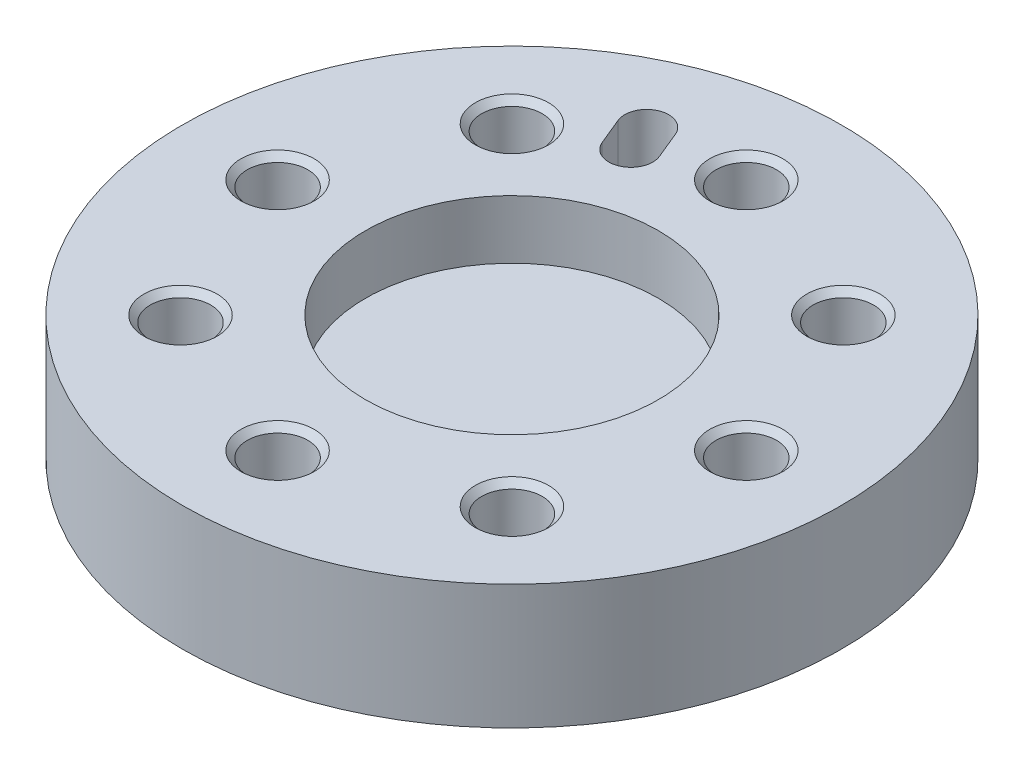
ISO-10303-21;
HEADER;
FILE_DESCRIPTION(('STEP AP214'),'2;1');
FILE_NAME('part.step','',(''),(''),'','','');
FILE_SCHEMA(('AUTOMOTIVE_DESIGN { 1 0 10303 214 1 1 1 1 }'));
ENDSEC;
DATA;
#1=APPLICATION_CONTEXT('core data for automotive mechanical design processes');
#2=APPLICATION_PROTOCOL_DEFINITION('international standard','automotive_design',2000,#1);
#3=PRODUCT_CONTEXT('',#1,'mechanical');
#4=PRODUCT('Part','Part','',(#3));
#5=PRODUCT_RELATED_PRODUCT_CATEGORY('part','',(#4));
#6=PRODUCT_DEFINITION_FORMATION('','',#4);
#7=PRODUCT_DEFINITION_CONTEXT('part definition',#1,'design');
#8=PRODUCT_DEFINITION('design','',#6,#7);
#9=PRODUCT_DEFINITION_SHAPE('','',#8);
#10=(LENGTH_UNIT() NAMED_UNIT(*) SI_UNIT(.MILLI.,.METRE.));
#11=(NAMED_UNIT(*) PLANE_ANGLE_UNIT() SI_UNIT($,.RADIAN.));
#12=(NAMED_UNIT(*) SI_UNIT($,.STERADIAN.) SOLID_ANGLE_UNIT());
#13=UNCERTAINTY_MEASURE_WITH_UNIT(LENGTH_MEASURE(1.E-05),#10,'distance_accuracy_value','');
#14=(GEOMETRIC_REPRESENTATION_CONTEXT(3) GLOBAL_UNCERTAINTY_ASSIGNED_CONTEXT((#13)) GLOBAL_UNIT_ASSIGNED_CONTEXT((#10,
#11,#12)) REPRESENTATION_CONTEXT('',''));
#15=CARTESIAN_POINT('',(0.,0.,0.));
#16=DIRECTION('',(0.,0.,1.));
#17=DIRECTION('',(1.,0.,0.));
#18=AXIS2_PLACEMENT_3D('',#15,#16,#17);
#19=CARTESIAN_POINT('',(0.,-8.,-16.));
#20=DIRECTION('',(0.,1.,0.));
#21=DIRECTION('',(0.,0.,1.));
#22=AXIS2_PLACEMENT_3D('',#19,#20,#21);
#23=PLANE('',#22);
#24=CARTESIAN_POINT('',(0.,-8.,-16.));
#25=DIRECTION('',(0.,-1.,0.));
#26=DIRECTION('',(0.,0.,-1.));
#27=AXIS2_PLACEMENT_3D('',#24,#25,#26);
#28=CIRCLE('',#27,2.067);
#29=CARTESIAN_POINT('',(0.,-8.,-18.067));
#30=VERTEX_POINT('',#29);
#31=EDGE_CURVE('E20',#30,#30,#28,.F.);
#32=ORIENTED_EDGE('',*,*,#31,.T.);
#33=EDGE_LOOP('',(#32));
#34=FACE_BOUND('',#33,.T.);
#35=ADVANCED_FACE('F17',(#34),#23,.T.);
#36=CARTESIAN_POINT('',(-16.,-8.,0.));
#37=DIRECTION('',(0.,1.,0.));
#38=DIRECTION('',(0.,0.,1.));
#39=AXIS2_PLACEMENT_3D('',#36,#37,#38);
#40=PLANE('',#39);
#41=CARTESIAN_POINT('',(-16.,-8.,0.));
#42=DIRECTION('',(0.,-1.,0.));
#43=DIRECTION('',(0.,0.,-1.));
#44=AXIS2_PLACEMENT_3D('',#41,#42,#43);
#45=CIRCLE('',#44,2.067);
#46=CARTESIAN_POINT('',(-16.,-8.,-2.067));
#47=VERTEX_POINT('',#46);
#48=EDGE_CURVE('E165',#47,#47,#45,.F.);
#49=ORIENTED_EDGE('',*,*,#48,.T.);
#50=EDGE_LOOP('',(#49));
#51=FACE_BOUND('',#50,.T.);
#52=ADVANCED_FACE('F285',(#51),#40,.T.);
#53=CARTESIAN_POINT('',(0.,-8.,16.));
#54=DIRECTION('',(0.,1.,0.));
#55=DIRECTION('',(0.,0.,1.));
#56=AXIS2_PLACEMENT_3D('',#53,#54,#55);
#57=PLANE('',#56);
#58=CARTESIAN_POINT('',(0.,-8.,16.));
#59=DIRECTION('',(0.,-1.,0.));
#60=DIRECTION('',(0.,0.,-1.));
#61=AXIS2_PLACEMENT_3D('',#58,#59,#60);
#62=CIRCLE('',#61,2.067);
#63=CARTESIAN_POINT('',(0.,-8.,13.933));
#64=VERTEX_POINT('',#63);
#65=EDGE_CURVE('E163',#64,#64,#62,.F.);
#66=ORIENTED_EDGE('',*,*,#65,.T.);
#67=EDGE_LOOP('',(#66));
#68=FACE_BOUND('',#67,.T.);
#69=ADVANCED_FACE('F282',(#68),#57,.T.);
#70=CARTESIAN_POINT('',(16.,-8.,0.));
#71=DIRECTION('',(0.,1.,0.));
#72=DIRECTION('',(0.,0.,1.));
#73=AXIS2_PLACEMENT_3D('',#70,#71,#72);
#74=PLANE('',#73);
#75=CARTESIAN_POINT('',(16.,-8.,0.));
#76=DIRECTION('',(0.,-1.,0.));
#77=DIRECTION('',(0.,0.,-1.));
#78=AXIS2_PLACEMENT_3D('',#75,#76,#77);
#79=CIRCLE('',#78,2.067);
#80=CARTESIAN_POINT('',(16.,-8.,-2.067));
#81=VERTEX_POINT('',#80);
#82=EDGE_CURVE('E160',#81,#81,#79,.F.);
#83=ORIENTED_EDGE('',*,*,#82,.T.);
#84=EDGE_LOOP('',(#83));
#85=FACE_BOUND('',#84,.T.);
#86=ADVANCED_FACE('F278',(#85),#74,.T.);
#87=CARTESIAN_POINT('',(11.3137084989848,-8.,11.3137084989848));
#88=DIRECTION('',(0.,1.,0.));
#89=DIRECTION('',(0.,0.,1.));
#90=AXIS2_PLACEMENT_3D('',#87,#88,#89);
#91=PLANE('',#90);
#92=CARTESIAN_POINT('',(11.3137084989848,-8.,11.3137084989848));
#93=DIRECTION('',(0.,-1.,0.));
#94=DIRECTION('',(0.,0.,-1.));
#95=AXIS2_PLACEMENT_3D('',#92,#93,#94);
#96=CIRCLE('',#95,2.067);
#97=CARTESIAN_POINT('',(11.3137084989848,-8.,9.24670849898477));
#98=VERTEX_POINT('',#97);
#99=EDGE_CURVE('E157',#98,#98,#96,.F.);
#100=ORIENTED_EDGE('',*,*,#99,.T.);
#101=EDGE_LOOP('',(#100));
#102=FACE_BOUND('',#101,.T.);
#103=ADVANCED_FACE('F274',(#102),#91,.T.);
#104=CARTESIAN_POINT('',(-11.3137084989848,-8.,11.3137084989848));
#105=DIRECTION('',(0.,1.,0.));
#106=DIRECTION('',(0.,0.,1.));
#107=AXIS2_PLACEMENT_3D('',#104,#105,#106);
#108=PLANE('',#107);
#109=CARTESIAN_POINT('',(-11.3137084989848,-8.,11.3137084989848));
#110=DIRECTION('',(0.,-1.,0.));
#111=DIRECTION('',(0.,0.,-1.));
#112=AXIS2_PLACEMENT_3D('',#109,#110,#111);
#113=CIRCLE('',#112,2.067);
#114=CARTESIAN_POINT('',(-11.3137084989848,-8.,9.24670849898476));
#115=VERTEX_POINT('',#114);
#116=EDGE_CURVE('E154',#115,#115,#113,.F.);
#117=ORIENTED_EDGE('',*,*,#116,.T.);
#118=EDGE_LOOP('',(#117));
#119=FACE_BOUND('',#118,.T.);
#120=ADVANCED_FACE('F270',(#119),#108,.T.);
#121=CARTESIAN_POINT('',(-11.3137084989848,-8.,-11.3137084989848));
#122=DIRECTION('',(0.,1.,0.));
#123=DIRECTION('',(0.,0.,1.));
#124=AXIS2_PLACEMENT_3D('',#121,#122,#123);
#125=PLANE('',#124);
#126=CARTESIAN_POINT('',(-11.3137084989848,-8.,-11.3137084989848));
#127=DIRECTION('',(0.,-1.,0.));
#128=DIRECTION('',(0.,0.,-1.));
#129=AXIS2_PLACEMENT_3D('',#126,#127,#128);
#130=CIRCLE('',#129,2.067);
#131=CARTESIAN_POINT('',(-11.3137084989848,-8.,-13.3807084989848));
#132=VERTEX_POINT('',#131);
#133=EDGE_CURVE('E151',#132,#132,#130,.F.);
#134=ORIENTED_EDGE('',*,*,#133,.T.);
#135=EDGE_LOOP('',(#134));
#136=FACE_BOUND('',#135,.T.);
#137=ADVANCED_FACE('F266',(#136),#125,.T.);
#138=CARTESIAN_POINT('',(11.3137084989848,-8.,-11.3137084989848));
#139=DIRECTION('',(0.,1.,0.));
#140=DIRECTION('',(0.,0.,1.));
#141=AXIS2_PLACEMENT_3D('',#138,#139,#140);
#142=PLANE('',#141);
#143=CARTESIAN_POINT('',(11.3137084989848,-8.,-11.3137084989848));
#144=DIRECTION('',(0.,-1.,0.));
#145=DIRECTION('',(0.,0.,-1.));
#146=AXIS2_PLACEMENT_3D('',#143,#144,#145);
#147=CIRCLE('',#146,2.067);
#148=CARTESIAN_POINT('',(11.3137084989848,-8.,-13.3807084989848));
#149=VERTEX_POINT('',#148);
#150=EDGE_CURVE('E67',#149,#149,#147,.F.);
#151=ORIENTED_EDGE('',*,*,#150,.T.);
#152=EDGE_LOOP('',(#151));
#153=FACE_BOUND('',#152,.T.);
#154=ADVANCED_FACE('F263',(#153),#142,.T.);
#155=CARTESIAN_POINT('',(-6.50561835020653,-3.5,-15.7059520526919));
#156=DIRECTION('',(0.,1.,0.));
#157=DIRECTION('',(0.,0.,1.));
#158=AXIS2_PLACEMENT_3D('',#155,#156,#157);
#159=PLANE('',#158);
#160=CARTESIAN_POINT('',(-5.74025148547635,-3.5,-13.8581929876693));
#161=DIRECTION('',(0.,1.,0.));
#162=DIRECTION('',(0.,0.,1.));
#163=AXIS2_PLACEMENT_3D('',#160,#161,#162);
#164=CIRCLE('',#163,1.5);
#165=CARTESIAN_POINT('',(-7.12607078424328,-3.5,-13.2841678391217));
#166=VERTEX_POINT('',#165);
#167=CARTESIAN_POINT('',(-4.35443218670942,-3.5,-14.4322181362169));
#168=VERTEX_POINT('',#167);
#169=EDGE_CURVE('E56',#166,#168,#164,.T.);
#170=ORIENTED_EDGE('',*,*,#169,.T.);
#171=DIRECTION('',(-0.38268343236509,0.,-0.923879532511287));
#172=VECTOR('',#171,1.);
#173=CARTESIAN_POINT('',(-4.35443218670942,-3.5,-14.4322181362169));
#174=LINE('',#173,#172);
#175=CARTESIAN_POINT('',(-5.1197990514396,-3.5,-16.2799772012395));
#176=VERTEX_POINT('',#175);
#177=EDGE_CURVE('E59',#168,#176,#174,.T.);
#178=ORIENTED_EDGE('',*,*,#177,.T.);
#179=CARTESIAN_POINT('',(-6.50561835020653,-3.5,-15.7059520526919));
#180=DIRECTION('',(0.,1.,0.));
#181=DIRECTION('',(0.,0.,1.));
#182=AXIS2_PLACEMENT_3D('',#179,#180,#181);
#183=CIRCLE('',#182,1.5);
#184=CARTESIAN_POINT('',(-7.89143764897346,-3.5,-15.1319269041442));
#185=VERTEX_POINT('',#184);
#186=EDGE_CURVE('E147',#176,#185,#183,.T.);
#187=ORIENTED_EDGE('',*,*,#186,.T.);
#188=DIRECTION('',(0.38268343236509,0.,0.923879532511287));
#189=VECTOR('',#188,1.);
#190=CARTESIAN_POINT('',(-7.89143764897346,-3.5,-15.1319269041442));
#191=LINE('',#190,#189);
#192=EDGE_CURVE('E61',#185,#166,#191,.T.);
#193=ORIENTED_EDGE('',*,*,#192,.T.);
#194=EDGE_LOOP('',(#170,#178,#187,#193));
#195=FACE_BOUND('',#194,.T.);
#196=ADVANCED_FACE('F58',(#195),#159,.T.);
#197=CARTESIAN_POINT('',(0.,0.,-16.));
#198=DIRECTION('',(0.,-1.,0.));
#199=DIRECTION('',(0.,0.,-1.));
#200=AXIS2_PLACEMENT_3D('',#197,#198,#199);
#201=CYLINDRICAL_SURFACE('',#200,2.067);
#202=ORIENTED_EDGE('',*,*,#31,.F.);
#203=EDGE_LOOP('',(#202));
#204=FACE_BOUND('',#203,.T.);
#205=CARTESIAN_POINT('',(0.,-0.432999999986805,-16.));
#206=DIRECTION('',(0.,1.,0.));
#207=DIRECTION('',(0.,0.,1.));
#208=AXIS2_PLACEMENT_3D('',#205,#206,#207);
#209=CIRCLE('',#208,2.06699999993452);
#210=CARTESIAN_POINT('',(0.,-0.432999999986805,-13.9330000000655));
#211=VERTEX_POINT('',#210);
#212=EDGE_CURVE('E105',#211,#211,#209,.T.);
#213=ORIENTED_EDGE('',*,*,#212,.T.);
#214=EDGE_LOOP('',(#213));
#215=FACE_BOUND('',#214,.T.);
#216=ADVANCED_FACE('F173',(#204,#215),#201,.F.);
#217=CARTESIAN_POINT('',(-16.,0.,0.));
#218=DIRECTION('',(0.,-1.,0.));
#219=DIRECTION('',(0.,0.,-1.));
#220=AXIS2_PLACEMENT_3D('',#217,#218,#219);
#221=CYLINDRICAL_SURFACE('',#220,2.067);
#222=ORIENTED_EDGE('',*,*,#48,.F.);
#223=EDGE_LOOP('',(#222));
#224=FACE_BOUND('',#223,.T.);
#225=CARTESIAN_POINT('',(-16.,-0.432999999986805,0.));
#226=DIRECTION('',(0.,1.,0.));
#227=DIRECTION('',(0.,0.,1.));
#228=AXIS2_PLACEMENT_3D('',#225,#226,#227);
#229=CIRCLE('',#228,2.06700000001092);
#230=CARTESIAN_POINT('',(-16.,-0.432999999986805,2.06700000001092));
#231=VERTEX_POINT('',#230);
#232=EDGE_CURVE('E102',#231,#231,#229,.T.);
#233=ORIENTED_EDGE('',*,*,#232,.T.);
#234=EDGE_LOOP('',(#233));
#235=FACE_BOUND('',#234,.T.);
#236=ADVANCED_FACE('F176',(#224,#235),#221,.F.);
#237=CARTESIAN_POINT('',(0.,0.,16.));
#238=DIRECTION('',(0.,-1.,0.));
#239=DIRECTION('',(0.,0.,-1.));
#240=AXIS2_PLACEMENT_3D('',#237,#238,#239);
#241=CYLINDRICAL_SURFACE('',#240,2.067);
#242=ORIENTED_EDGE('',*,*,#65,.F.);
#243=EDGE_LOOP('',(#242));
#244=FACE_BOUND('',#243,.T.);
#245=CARTESIAN_POINT('',(0.,-0.432999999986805,16.));
#246=DIRECTION('',(0.,1.,0.));
#247=DIRECTION('',(0.,0.,1.));
#248=AXIS2_PLACEMENT_3D('',#245,#246,#247);
#249=CIRCLE('',#248,2.06699999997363);
#250=CARTESIAN_POINT('',(0.,-0.432999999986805,18.0669999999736));
#251=VERTEX_POINT('',#250);
#252=EDGE_CURVE('E99',#251,#251,#249,.T.);
#253=ORIENTED_EDGE('',*,*,#252,.T.);
#254=EDGE_LOOP('',(#253));
#255=FACE_BOUND('',#254,.T.);
#256=ADVANCED_FACE('F244',(#244,#255),#241,.F.);
#257=CARTESIAN_POINT('',(16.,0.,0.));
#258=DIRECTION('',(0.,-1.,0.));
#259=DIRECTION('',(0.,0.,-1.));
#260=AXIS2_PLACEMENT_3D('',#257,#258,#259);
#261=CYLINDRICAL_SURFACE('',#260,2.067);
#262=ORIENTED_EDGE('',*,*,#82,.F.);
#263=EDGE_LOOP('',(#262));
#264=FACE_BOUND('',#263,.T.);
#265=CARTESIAN_POINT('',(16.,-0.432999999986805,0.));
#266=DIRECTION('',(0.,1.,0.));
#267=DIRECTION('',(0.,0.,1.));
#268=AXIS2_PLACEMENT_3D('',#265,#266,#267);
#269=CIRCLE('',#268,2.06699999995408);
#270=CARTESIAN_POINT('',(16.,-0.432999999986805,2.06699999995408));
#271=VERTEX_POINT('',#270);
#272=EDGE_CURVE('E96',#271,#271,#269,.T.);
#273=ORIENTED_EDGE('',*,*,#272,.T.);
#274=EDGE_LOOP('',(#273));
#275=FACE_BOUND('',#274,.T.);
#276=ADVANCED_FACE('F246',(#264,#275),#261,.F.);
#277=CARTESIAN_POINT('',(0.,-4.,0.));
#278=DIRECTION('',(0.,-1.,0.));
#279=DIRECTION('',(0.,0.,-1.));
#280=AXIS2_PLACEMENT_3D('',#277,#278,#279);
#281=PLANE('',#280);
#282=CARTESIAN_POINT('',(0.,-4.,0.));
#283=DIRECTION('',(0.,1.,0.));
#284=DIRECTION('',(0.,0.,1.));
#285=AXIS2_PLACEMENT_3D('',#282,#283,#284);
#286=CIRCLE('',#285,10.);
#287=CARTESIAN_POINT('',(0.,-4.,10.));
#288=VERTEX_POINT('',#287);
#289=EDGE_CURVE('E95',#288,#288,#286,.T.);
#290=ORIENTED_EDGE('',*,*,#289,.T.);
#291=EDGE_LOOP('',(#290));
#292=FACE_BOUND('',#291,.T.);
#293=ADVANCED_FACE('F253',(#292),#281,.F.);
#294=CARTESIAN_POINT('',(11.3137084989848,0.,11.3137084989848));
#295=DIRECTION('',(0.,-1.,0.));
#296=DIRECTION('',(0.,0.,-1.));
#297=AXIS2_PLACEMENT_3D('',#294,#295,#296);
#298=CYLINDRICAL_SURFACE('',#297,2.067);
#299=ORIENTED_EDGE('',*,*,#99,.F.);
#300=EDGE_LOOP('',(#299));
#301=FACE_BOUND('',#300,.T.);
#302=CARTESIAN_POINT('',(11.3137084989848,-0.432999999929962,11.3137084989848));
#303=DIRECTION('',(0.,1.,0.));
#304=DIRECTION('',(0.,0.,1.));
#305=AXIS2_PLACEMENT_3D('',#302,#303,#304);
#306=CIRCLE('',#305,2.06700000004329);
#307=CARTESIAN_POINT('',(11.3137084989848,-0.432999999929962,13.3807084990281));
#308=VERTEX_POINT('',#307);
#309=EDGE_CURVE('E92',#308,#308,#306,.T.);
#310=ORIENTED_EDGE('',*,*,#309,.T.);
#311=EDGE_LOOP('',(#310));
#312=FACE_BOUND('',#311,.T.);
#313=ADVANCED_FACE('F377',(#301,#312),#298,.F.);
#314=CARTESIAN_POINT('',(-11.3137084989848,0.,11.3137084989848));
#315=DIRECTION('',(0.,-1.,0.));
#316=DIRECTION('',(0.,0.,-1.));
#317=AXIS2_PLACEMENT_3D('',#314,#315,#316);
#318=CYLINDRICAL_SURFACE('',#317,2.067);
#319=ORIENTED_EDGE('',*,*,#116,.F.);
#320=EDGE_LOOP('',(#319));
#321=FACE_BOUND('',#320,.T.);
#322=CARTESIAN_POINT('',(-11.3137084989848,-0.432999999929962,11.3137084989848));
#323=DIRECTION('',(0.,1.,0.));
#324=DIRECTION('',(0.,0.,1.));
#325=AXIS2_PLACEMENT_3D('',#322,#323,#324);
#326=CIRCLE('',#325,2.0670000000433);
#327=CARTESIAN_POINT('',(-11.3137084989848,-0.432999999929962,13.3807084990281));
#328=VERTEX_POINT('',#327);
#329=EDGE_CURVE('E89',#328,#328,#326,.T.);
#330=ORIENTED_EDGE('',*,*,#329,.T.);
#331=EDGE_LOOP('',(#330));
#332=FACE_BOUND('',#331,.T.);
#333=ADVANCED_FACE('F386',(#321,#332),#318,.F.);
#334=CARTESIAN_POINT('',(-11.3137084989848,0.,-11.3137084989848));
#335=DIRECTION('',(0.,-1.,0.));
#336=DIRECTION('',(0.,0.,-1.));
#337=AXIS2_PLACEMENT_3D('',#334,#335,#336);
#338=CYLINDRICAL_SURFACE('',#337,2.067);
#339=ORIENTED_EDGE('',*,*,#133,.F.);
#340=EDGE_LOOP('',(#339));
#341=FACE_BOUND('',#340,.T.);
#342=CARTESIAN_POINT('',(-11.3137084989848,-0.432999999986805,-11.3137084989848));
#343=DIRECTION('',(0.,1.,0.));
#344=DIRECTION('',(0.,0.,1.));
#345=AXIS2_PLACEMENT_3D('',#342,#343,#344);
#346=CIRCLE('',#345,2.06699999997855);
#347=CARTESIAN_POINT('',(-11.3137084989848,-0.432999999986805,-9.24670849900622));
#348=VERTEX_POINT('',#347);
#349=EDGE_CURVE('E86',#348,#348,#346,.T.);
#350=ORIENTED_EDGE('',*,*,#349,.T.);
#351=EDGE_LOOP('',(#350));
#352=FACE_BOUND('',#351,.T.);
#353=ADVANCED_FACE('F395',(#341,#352),#338,.F.);
#354=CARTESIAN_POINT('',(11.3137084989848,0.,-11.3137084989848));
#355=DIRECTION('',(0.,-1.,0.));
#356=DIRECTION('',(0.,0.,-1.));
#357=AXIS2_PLACEMENT_3D('',#354,#355,#356);
#358=CYLINDRICAL_SURFACE('',#357,2.067);
#359=ORIENTED_EDGE('',*,*,#150,.F.);
#360=EDGE_LOOP('',(#359));
#361=FACE_BOUND('',#360,.T.);
#362=CARTESIAN_POINT('',(11.3137084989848,-0.432999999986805,-11.3137084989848));
#363=DIRECTION('',(0.,1.,0.));
#364=DIRECTION('',(0.,0.,1.));
#365=AXIS2_PLACEMENT_3D('',#362,#363,#364);
#366=CIRCLE('',#365,2.06699999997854);
#367=CARTESIAN_POINT('',(11.3137084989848,-0.432999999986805,-9.24670849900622));
#368=VERTEX_POINT('',#367);
#369=EDGE_CURVE('E83',#368,#368,#366,.T.);
#370=ORIENTED_EDGE('',*,*,#369,.T.);
#371=EDGE_LOOP('',(#370));
#372=FACE_BOUND('',#371,.T.);
#373=ADVANCED_FACE('F405',(#361,#372),#358,.F.);
#374=CARTESIAN_POINT('',(-5.74025148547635,-3.5,-13.8581929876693));
#375=DIRECTION('',(0.,1.,0.));
#376=DIRECTION('',(0.,0.,1.));
#377=AXIS2_PLACEMENT_3D('',#374,#375,#376);
#378=CYLINDRICAL_SURFACE('',#377,1.5);
#379=ORIENTED_EDGE('',*,*,#169,.F.);
#380=DIRECTION('',(0.,1.,0.));
#381=VECTOR('',#380,1.);
#382=CARTESIAN_POINT('',(-7.12607078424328,-3.5,-13.2841678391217));
#383=LINE('',#382,#381);
#384=CARTESIAN_POINT('',(-7.12607078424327,0.,-13.2841678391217));
#385=VERTEX_POINT('',#384);
#386=EDGE_CURVE('E108',#166,#385,#383,.T.);
#387=ORIENTED_EDGE('',*,*,#386,.T.);
#388=CARTESIAN_POINT('',(-5.74025148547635,0.,-13.8581929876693));
#389=DIRECTION('',(0.,1.,0.));
#390=DIRECTION('',(0.,0.,1.));
#391=AXIS2_PLACEMENT_3D('',#388,#389,#390);
#392=CIRCLE('',#391,1.5);
#393=CARTESIAN_POINT('',(-4.35443218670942,0.,-14.4322181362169));
#394=VERTEX_POINT('',#393);
#395=EDGE_CURVE('E78',#385,#394,#392,.T.);
#396=ORIENTED_EDGE('',*,*,#395,.T.);
#397=DIRECTION('',(0.,1.,0.));
#398=VECTOR('',#397,1.);
#399=CARTESIAN_POINT('',(-4.35443218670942,-3.5,-14.4322181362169));
#400=LINE('',#399,#398);
#401=EDGE_CURVE('E66',#394,#168,#400,.F.);
#402=ORIENTED_EDGE('',*,*,#401,.T.);
#403=EDGE_LOOP('',(#379,#387,#396,#402));
#404=FACE_BOUND('',#403,.T.);
#405=ADVANCED_FACE('F77',(#404),#378,.F.);
#406=CARTESIAN_POINT('',(-4.35443218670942,-3.5,-14.4322181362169));
#407=DIRECTION('',(0.923879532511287,0.,-0.38268343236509));
#408=DIRECTION('',(-0.38268343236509,0.,-0.923879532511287));
#409=AXIS2_PLACEMENT_3D('',#406,#407,#408);
#410=PLANE('',#409);
#411=DIRECTION('',(0.,1.,0.));
#412=VECTOR('',#411,1.);
#413=CARTESIAN_POINT('',(-5.1197990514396,-3.5,-16.2799772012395));
#414=LINE('',#413,#412);
#415=CARTESIAN_POINT('',(-5.1197990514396,0.,-16.2799772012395));
#416=VERTEX_POINT('',#415);
#417=EDGE_CURVE('E74',#416,#176,#414,.F.);
#418=ORIENTED_EDGE('',*,*,#417,.T.);
#419=ORIENTED_EDGE('',*,*,#177,.F.);
#420=ORIENTED_EDGE('',*,*,#401,.F.);
#421=DIRECTION('',(-0.38268343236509,0.,-0.923879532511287));
#422=VECTOR('',#421,1.);
#423=CARTESIAN_POINT('',(-4.35443218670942,0.,-14.4322181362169));
#424=LINE('',#423,#422);
#425=EDGE_CURVE('E143',#394,#416,#424,.T.);
#426=ORIENTED_EDGE('',*,*,#425,.T.);
#427=EDGE_LOOP('',(#418,#419,#420,#426));
#428=FACE_BOUND('',#427,.T.);
#429=ADVANCED_FACE('F71',(#428),#410,.F.);
#430=CARTESIAN_POINT('',(-6.50561835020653,-3.5,-15.7059520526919));
#431=DIRECTION('',(0.,1.,0.));
#432=DIRECTION('',(0.,0.,1.));
#433=AXIS2_PLACEMENT_3D('',#430,#431,#432);
#434=CYLINDRICAL_SURFACE('',#433,1.5);
#435=DIRECTION('',(0.,1.,0.));
#436=VECTOR('',#435,1.);
#437=CARTESIAN_POINT('',(-7.89143764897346,-3.5,-15.1319269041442));
#438=LINE('',#437,#436);
#439=CARTESIAN_POINT('',(-7.89143764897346,0.,-15.1319269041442));
#440=VERTEX_POINT('',#439);
#441=EDGE_CURVE('E35',#440,#185,#438,.F.);
#442=ORIENTED_EDGE('',*,*,#441,.T.);
#443=ORIENTED_EDGE('',*,*,#186,.F.);
#444=ORIENTED_EDGE('',*,*,#417,.F.);
#445=CARTESIAN_POINT('',(-6.50561835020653,0.,-15.7059520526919));
#446=DIRECTION('',(0.,1.,0.));
#447=DIRECTION('',(0.,0.,1.));
#448=AXIS2_PLACEMENT_3D('',#445,#446,#447);
#449=CIRCLE('',#448,1.5);
#450=EDGE_CURVE('E140',#416,#440,#449,.T.);
#451=ORIENTED_EDGE('',*,*,#450,.T.);
#452=EDGE_LOOP('',(#442,#443,#444,#451));
#453=FACE_BOUND('',#452,.T.);
#454=ADVANCED_FACE('F194',(#453),#434,.F.);
#455=CARTESIAN_POINT('',(-7.89143764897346,-3.5,-15.1319269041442));
#456=DIRECTION('',(-0.923879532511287,0.,0.38268343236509));
#457=DIRECTION('',(0.38268343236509,0.,0.923879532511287));
#458=AXIS2_PLACEMENT_3D('',#455,#456,#457);
#459=PLANE('',#458);
#460=ORIENTED_EDGE('',*,*,#386,.F.);
#461=ORIENTED_EDGE('',*,*,#192,.F.);
#462=ORIENTED_EDGE('',*,*,#441,.F.);
#463=DIRECTION('',(0.382683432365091,0.,0.923879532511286));
#464=VECTOR('',#463,1.);
#465=CARTESIAN_POINT('',(-7.89143764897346,0.,-15.1319269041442));
#466=LINE('',#465,#464);
#467=EDGE_CURVE('E139',#440,#385,#466,.T.);
#468=ORIENTED_EDGE('',*,*,#467,.T.);
#469=EDGE_LOOP('',(#460,#461,#462,#468));
#470=FACE_BOUND('',#469,.T.);
#471=ADVANCED_FACE('F183',(#470),#459,.F.);
#472=CARTESIAN_POINT('',(0.,0.,-16.));
#473=DIRECTION('',(0.,1.,0.));
#474=DIRECTION('',(0.,0.,1.));
#475=AXIS2_PLACEMENT_3D('',#472,#473,#474);
#476=CONICAL_SURFACE('',#475,2.49999999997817,0.785398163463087);
#477=CARTESIAN_POINT('',(0.,1.95538030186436E-11,-16.));
#478=DIRECTION('',(0.,1.,0.));
#479=DIRECTION('',(0.,0.,1.));
#480=AXIS2_PLACEMENT_3D('',#477,#478,#479);
#481=CIRCLE('',#480,2.49999999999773);
#482=CARTESIAN_POINT('',(0.,1.95538030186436E-11,-13.5000000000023));
#483=VERTEX_POINT('',#482);
#484=EDGE_CURVE('E136',#483,#483,#481,.T.);
#485=ORIENTED_EDGE('',*,*,#484,.T.);
#486=EDGE_LOOP('',(#485));
#487=FACE_BOUND('',#486,.T.);
#488=ORIENTED_EDGE('',*,*,#212,.F.);
#489=EDGE_LOOP('',(#488));
#490=FACE_BOUND('',#489,.T.);
#491=ADVANCED_FACE('F180',(#487,#490),#476,.F.);
#492=CARTESIAN_POINT('',(-16.,-5.6843418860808E-11,0.));
#493=DIRECTION('',(0.,1.,0.));
#494=DIRECTION('',(0.,0.,1.));
#495=AXIS2_PLACEMENT_3D('',#492,#493,#494);
#496=CONICAL_SURFACE('',#495,2.49999999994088,0.785398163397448);
#497=CARTESIAN_POINT('',(-16.,0.,0.));
#498=DIRECTION('',(0.,1.,0.));
#499=DIRECTION('',(0.,0.,1.));
#500=AXIS2_PLACEMENT_3D('',#497,#498,#499);
#501=CIRCLE('',#500,2.49999999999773);
#502=CARTESIAN_POINT('',(-16.,0.,2.49999999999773));
#503=VERTEX_POINT('',#502);
#504=EDGE_CURVE('E133',#503,#503,#501,.T.);
#505=ORIENTED_EDGE('',*,*,#504,.T.);
#506=EDGE_LOOP('',(#505));
#507=FACE_BOUND('',#506,.T.);
#508=ORIENTED_EDGE('',*,*,#232,.F.);
#509=EDGE_LOOP('',(#508));
#510=FACE_BOUND('',#509,.T.);
#511=ADVANCED_FACE('F182',(#507,#510),#496,.F.);
#512=CARTESIAN_POINT('',(0.,5.6843418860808E-11,16.));
#513=DIRECTION('',(0.,1.,0.));
#514=DIRECTION('',(0.,0.,1.));
#515=AXIS2_PLACEMENT_3D('',#512,#513,#514);
#516=CONICAL_SURFACE('',#515,2.49999999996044,0.785398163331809);
#517=CARTESIAN_POINT('',(0.,5.6843418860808E-11,16.));
#518=DIRECTION('',(0.,1.,0.));
#519=DIRECTION('',(0.,0.,1.));
#520=AXIS2_PLACEMENT_3D('',#517,#518,#519);
#521=CIRCLE('',#520,2.49999999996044);
#522=CARTESIAN_POINT('',(0.,5.6843418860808E-11,18.4999999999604));
#523=VERTEX_POINT('',#522);
#524=EDGE_CURVE('E130',#523,#523,#521,.T.);
#525=ORIENTED_EDGE('',*,*,#524,.T.);
#526=EDGE_LOOP('',(#525));
#527=FACE_BOUND('',#526,.T.);
#528=ORIENTED_EDGE('',*,*,#252,.F.);
#529=EDGE_LOOP('',(#528));
#530=FACE_BOUND('',#529,.T.);
#531=ADVANCED_FACE('F191',(#527,#530),#516,.F.);
#532=CARTESIAN_POINT('',(16.,1.13686837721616E-10,0.));
#533=DIRECTION('',(0.,1.,0.));
#534=DIRECTION('',(0.,0.,1.));
#535=AXIS2_PLACEMENT_3D('',#532,#533,#534);
#536=CONICAL_SURFACE('',#535,2.50000000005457,0.785398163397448);
#537=CARTESIAN_POINT('',(16.,0.,0.));
#538=DIRECTION('',(0.,1.,0.));
#539=DIRECTION('',(0.,0.,1.));
#540=AXIS2_PLACEMENT_3D('',#537,#538,#539);
#541=CIRCLE('',#540,2.49999999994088);
#542=CARTESIAN_POINT('',(16.,0.,2.49999999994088));
#543=VERTEX_POINT('',#542);
#544=EDGE_CURVE('E127',#543,#543,#541,.T.);
#545=ORIENTED_EDGE('',*,*,#544,.T.);
#546=EDGE_LOOP('',(#545));
#547=FACE_BOUND('',#546,.T.);
#548=ORIENTED_EDGE('',*,*,#272,.F.);
#549=EDGE_LOOP('',(#548));
#550=FACE_BOUND('',#549,.T.);
#551=ADVANCED_FACE('F231',(#547,#550),#536,.F.);
#552=CARTESIAN_POINT('',(0.,-8.5,0.));
#553=DIRECTION('',(0.,1.,0.));
#554=DIRECTION('',(0.,0.,1.));
#555=AXIS2_PLACEMENT_3D('',#552,#553,#554);
#556=CYLINDRICAL_SURFACE('',#555,10.);
#557=ORIENTED_EDGE('',*,*,#289,.F.);
#558=EDGE_LOOP('',(#557));
#559=FACE_BOUND('',#558,.T.);
#560=CARTESIAN_POINT('',(0.,0.,0.));
#561=DIRECTION('',(0.,1.,0.));
#562=DIRECTION('',(0.,0.,1.));
#563=AXIS2_PLACEMENT_3D('',#560,#561,#562);
#564=CIRCLE('',#563,10.);
#565=CARTESIAN_POINT('',(0.,0.,10.));
#566=VERTEX_POINT('',#565);
#567=EDGE_CURVE('E124',#566,#566,#564,.T.);
#568=ORIENTED_EDGE('',*,*,#567,.T.);
#569=EDGE_LOOP('',(#568));
#570=FACE_BOUND('',#569,.T.);
#571=ADVANCED_FACE('F227',(#559,#570),#556,.F.);
#572=CARTESIAN_POINT('',(11.3137084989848,0.,11.3137084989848));
#573=DIRECTION('',(0.,1.,0.));
#574=DIRECTION('',(0.,0.,1.));
#575=AXIS2_PLACEMENT_3D('',#572,#573,#574);
#576=CONICAL_SURFACE('',#575,2.49999999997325,0.785398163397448);
#577=CARTESIAN_POINT('',(11.3137084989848,0.,11.3137084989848));
#578=DIRECTION('',(0.,1.,0.));
#579=DIRECTION('',(0.,0.,1.));
#580=AXIS2_PLACEMENT_3D('',#577,#578,#579);
#581=CIRCLE('',#580,2.49999999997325);
#582=CARTESIAN_POINT('',(11.3137084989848,0.,13.813708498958));
#583=VERTEX_POINT('',#582);
#584=EDGE_CURVE('E121',#583,#583,#581,.T.);
#585=ORIENTED_EDGE('',*,*,#584,.T.);
#586=EDGE_LOOP('',(#585));
#587=FACE_BOUND('',#586,.T.);
#588=ORIENTED_EDGE('',*,*,#309,.F.);
#589=EDGE_LOOP('',(#588));
#590=FACE_BOUND('',#589,.T.);
#591=ADVANCED_FACE('F223',(#587,#590),#576,.F.);
#592=CARTESIAN_POINT('',(-11.3137084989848,0.,11.3137084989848));
#593=DIRECTION('',(0.,1.,0.));
#594=DIRECTION('',(0.,0.,1.));
#595=AXIS2_PLACEMENT_3D('',#592,#593,#594);
#596=CONICAL_SURFACE('',#595,2.49999999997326,0.785398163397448);
#597=CARTESIAN_POINT('',(-11.3137084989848,0.,11.3137084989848));
#598=DIRECTION('',(0.,1.,0.));
#599=DIRECTION('',(0.,0.,1.));
#600=AXIS2_PLACEMENT_3D('',#597,#598,#599);
#601=CIRCLE('',#600,2.49999999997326);
#602=CARTESIAN_POINT('',(-11.3137084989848,0.,13.813708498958));
#603=VERTEX_POINT('',#602);
#604=EDGE_CURVE('E118',#603,#603,#601,.T.);
#605=ORIENTED_EDGE('',*,*,#604,.T.);
#606=EDGE_LOOP('',(#605));
#607=FACE_BOUND('',#606,.T.);
#608=ORIENTED_EDGE('',*,*,#329,.F.);
#609=EDGE_LOOP('',(#608));
#610=FACE_BOUND('',#609,.T.);
#611=ADVANCED_FACE('F219',(#607,#610),#596,.F.);
#612=CARTESIAN_POINT('',(-11.3137084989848,0.,-11.3137084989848));
#613=DIRECTION('',(0.,1.,0.));
#614=DIRECTION('',(0.,0.,1.));
#615=AXIS2_PLACEMENT_3D('',#612,#613,#614);
#616=CONICAL_SURFACE('',#615,2.50000000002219,0.785398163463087);
#617=CARTESIAN_POINT('',(-11.3137084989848,-2.44682746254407E-11,-11.3137084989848));
#618=DIRECTION('',(0.,1.,0.));
#619=DIRECTION('',(0.,0.,1.));
#620=AXIS2_PLACEMENT_3D('',#617,#618,#619);
#621=CIRCLE('',#620,2.49999999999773);
#622=CARTESIAN_POINT('',(-11.3137084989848,-2.44682746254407E-11,-8.81370849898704));
#623=VERTEX_POINT('',#622);
#624=EDGE_CURVE('E115',#623,#623,#621,.T.);
#625=ORIENTED_EDGE('',*,*,#624,.T.);
#626=EDGE_LOOP('',(#625));
#627=FACE_BOUND('',#626,.T.);
#628=ORIENTED_EDGE('',*,*,#349,.F.);
#629=EDGE_LOOP('',(#628));
#630=FACE_BOUND('',#629,.T.);
#631=ADVANCED_FACE('F215',(#627,#630),#616,.F.);
#632=CARTESIAN_POINT('',(11.3137084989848,0.,-11.3137084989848));
#633=DIRECTION('',(0.,1.,0.));
#634=DIRECTION('',(0.,0.,1.));
#635=AXIS2_PLACEMENT_3D('',#632,#633,#634);
#636=CONICAL_SURFACE('',#635,2.50000000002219,0.785398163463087);
#637=CARTESIAN_POINT('',(11.3137084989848,-2.44648051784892E-11,-11.3137084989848));
#638=DIRECTION('',(0.,1.,0.));
#639=DIRECTION('',(0.,0.,1.));
#640=AXIS2_PLACEMENT_3D('',#637,#638,#639);
#641=CIRCLE('',#640,2.49999999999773);
#642=CARTESIAN_POINT('',(11.3137084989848,-2.44648051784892E-11,-8.81370849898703));
#643=VERTEX_POINT('',#642);
#644=EDGE_CURVE('E112',#643,#643,#641,.T.);
#645=ORIENTED_EDGE('',*,*,#644,.T.);
#646=EDGE_LOOP('',(#645));
#647=FACE_BOUND('',#646,.T.);
#648=ORIENTED_EDGE('',*,*,#369,.F.);
#649=EDGE_LOOP('',(#648));
#650=FACE_BOUND('',#649,.T.);
#651=ADVANCED_FACE('F211',(#647,#650),#636,.F.);
#652=CARTESIAN_POINT('',(10.,0.,0.));
#653=DIRECTION('',(0.,-1.,0.));
#654=DIRECTION('',(0.,0.,-1.));
#655=AXIS2_PLACEMENT_3D('',#652,#653,#654);
#656=PLANE('',#655);
#657=ORIENTED_EDGE('',*,*,#644,.F.);
#658=EDGE_LOOP('',(#657));
#659=FACE_BOUND('',#658,.T.);
#660=ORIENTED_EDGE('',*,*,#624,.F.);
#661=EDGE_LOOP('',(#660));
#662=FACE_BOUND('',#661,.T.);
#663=ORIENTED_EDGE('',*,*,#604,.F.);
#664=EDGE_LOOP('',(#663));
#665=FACE_BOUND('',#664,.T.);
#666=ORIENTED_EDGE('',*,*,#584,.F.);
#667=EDGE_LOOP('',(#666));
#668=FACE_BOUND('',#667,.T.);
#669=CARTESIAN_POINT('',(0.,0.,0.));
#670=DIRECTION('',(0.,1.,0.));
#671=DIRECTION('',(0.,0.,1.));
#672=AXIS2_PLACEMENT_3D('',#669,#670,#671);
#673=CIRCLE('',#672,22.5);
#674=CARTESIAN_POINT('',(0.,0.,22.5));
#675=VERTEX_POINT('',#674);
#676=EDGE_CURVE('E26',#675,#675,#673,.F.);
#677=ORIENTED_EDGE('',*,*,#676,.F.);
#678=EDGE_LOOP('',(#677));
#679=FACE_BOUND('',#678,.T.);
#680=ORIENTED_EDGE('',*,*,#567,.F.);
#681=EDGE_LOOP('',(#680));
#682=FACE_BOUND('',#681,.T.);
#683=ORIENTED_EDGE('',*,*,#544,.F.);
#684=EDGE_LOOP('',(#683));
#685=FACE_BOUND('',#684,.T.);
#686=ORIENTED_EDGE('',*,*,#524,.F.);
#687=EDGE_LOOP('',(#686));
#688=FACE_BOUND('',#687,.T.);
#689=ORIENTED_EDGE('',*,*,#504,.F.);
#690=EDGE_LOOP('',(#689));
#691=FACE_BOUND('',#690,.T.);
#692=ORIENTED_EDGE('',*,*,#484,.F.);
#693=EDGE_LOOP('',(#692));
#694=FACE_BOUND('',#693,.T.);
#695=ORIENTED_EDGE('',*,*,#450,.F.);
#696=ORIENTED_EDGE('',*,*,#425,.F.);
#697=ORIENTED_EDGE('',*,*,#395,.F.);
#698=ORIENTED_EDGE('',*,*,#467,.F.);
#699=EDGE_LOOP('',(#695,#696,#697,#698));
#700=FACE_BOUND('',#699,.T.);
#701=ADVANCED_FACE('F204',(#659,#662,#665,#668,#679,#682,#685,#688,#691,#694,#700),#656,.F.);
#702=CARTESIAN_POINT('',(0.,-8.5,0.));
#703=DIRECTION('',(0.,1.,0.));
#704=DIRECTION('',(0.,0.,1.));
#705=AXIS2_PLACEMENT_3D('',#702,#703,#704);
#706=CYLINDRICAL_SURFACE('',#705,22.5);
#707=ORIENTED_EDGE('',*,*,#676,.T.);
#708=EDGE_LOOP('',(#707));
#709=FACE_BOUND('',#708,.T.);
#710=CARTESIAN_POINT('',(0.,-8.5,0.));
#711=DIRECTION('',(0.,1.,0.));
#712=DIRECTION('',(0.,0.,1.));
#713=AXIS2_PLACEMENT_3D('',#710,#711,#712);
#714=CIRCLE('',#713,22.5);
#715=CARTESIAN_POINT('',(0.,-8.5,22.5));
#716=VERTEX_POINT('',#715);
#717=EDGE_CURVE('E11',#716,#716,#714,.T.);
#718=ORIENTED_EDGE('',*,*,#717,.T.);
#719=EDGE_LOOP('',(#718));
#720=FACE_BOUND('',#719,.T.);
#721=ADVANCED_FACE('F198',(#709,#720),#706,.T.);
#722=CARTESIAN_POINT('',(22.5,-8.5,0.));
#723=DIRECTION('',(0.,1.,0.));
#724=DIRECTION('',(0.,0.,1.));
#725=AXIS2_PLACEMENT_3D('',#722,#723,#724);
#726=PLANE('',#725);
#727=ORIENTED_EDGE('',*,*,#717,.F.);
#728=EDGE_LOOP('',(#727));
#729=FACE_BOUND('',#728,.T.);
#730=ADVANCED_FACE('F196',(#729),#726,.F.);
#731=CLOSED_SHELL('',(#35,#52,#69,#86,#103,#120,#137,#154,#196,#216,#236,#256,#276,#293,#313,
#333,#353,#373,#405,#429,#454,#471,#491,#511,#531,#551,#571,#591,#611,#631,#651,#701,#721,#730));
#732=MANIFOLD_SOLID_BREP('B1',#731);
#733=ADVANCED_BREP_SHAPE_REPRESENTATION('',(#18,#732),#14);
#734=SHAPE_DEFINITION_REPRESENTATION(#9,#733);
ENDSEC;
END-ISO-10303-21;
